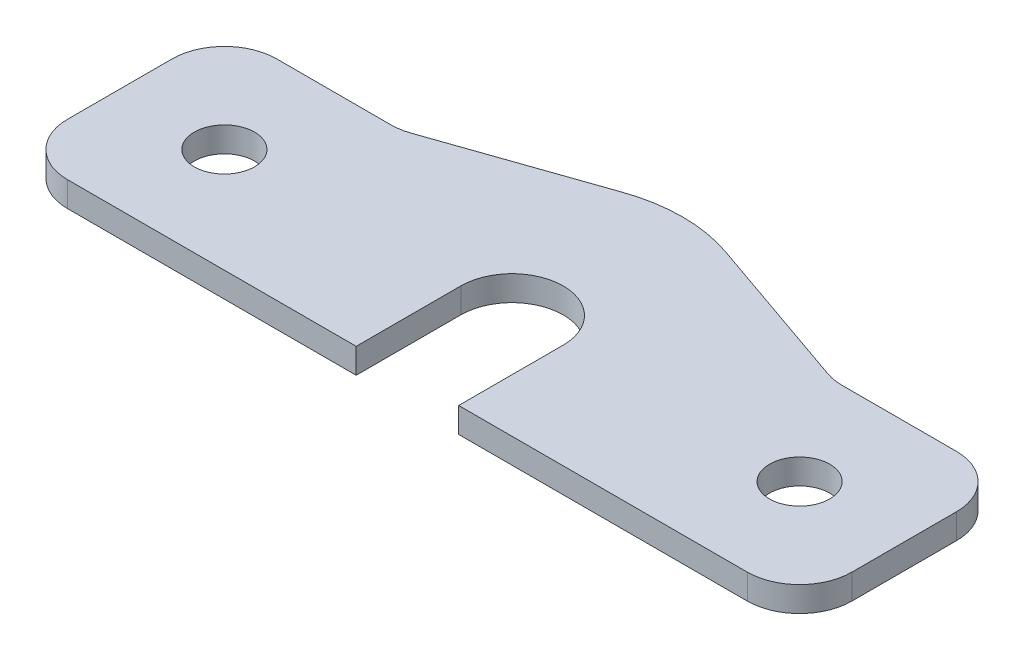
from build123d import *

# Parameters (mm, degrees)
SKETCH1_R           = 1.8288
BOSS_EXTRUDE1_DEPTH = 1.524
FILLET1_R           = 3.175


with BuildPart() as part:
    # Sketch1 → Boss-Extrude1 (new body)
    with BuildSketch(Plane(origin=(0, 0, 0), x_dir=(1, 0, 0), z_dir=(0, 1, 0))):
        with BuildLine():
            Line((-23.8125, -6.35), (-3.1115, -6.35))
            Line((-3.1115, -6.35), (-3.1115, 0))
            ThreePointArc((-3.1115, 0), (0, 3.1115), (3.1115, 0))
            Line((3.1115, 0), (3.1115, -6.35))
            Line((3.1115, -6.35), (23.8125, -6.35))
            Line((23.8125, -6.35), (23.8125, 6.35))
            Line((23.8125, 6.35), (13.162923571, 6.35))
            Line((13.162923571, 6.35), (3.124781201, 9.836053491))
            ThreePointArc((3.124781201, 9.836053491), (0, 10.3632), (-3.124781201, 9.836053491))
            Line((-3.124781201, 9.836053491), (-13.162923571, 6.35))
            Line((-13.162923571, 6.35), (-23.8125, 6.35))
            Line((-23.8125, 6.35), (-23.8125, -6.35))
        make_face()
        with Locations(Location((17.4625, 0, 0), (0, 0, 90))):
            Circle(SKETCH1_R, mode=Mode.SUBTRACT)
        with Locations(Location((-17.4625, 0, 0), (0, 0, 90))):
            Circle(SKETCH1_R, mode=Mode.SUBTRACT)
    extrude(amount=BOSS_EXTRUDE1_DEPTH)

    # Fillet1
    fillet1_edges = [part.edges().sort_by_distance(p)[0] for p in [
        (-23.8125, 0.762, 6.35),
        (-23.8125, 0.762, -6.35),
        (-13.162923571, 0.762, -6.35),
        (13.162923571, 0.762, -6.35),
        (23.8125, 0.762, -6.35),
        (23.8125, 0.762, 6.35),
    ]]
    fillet(fillet1_edges, radius=FILLET1_R)


solid = part.part
